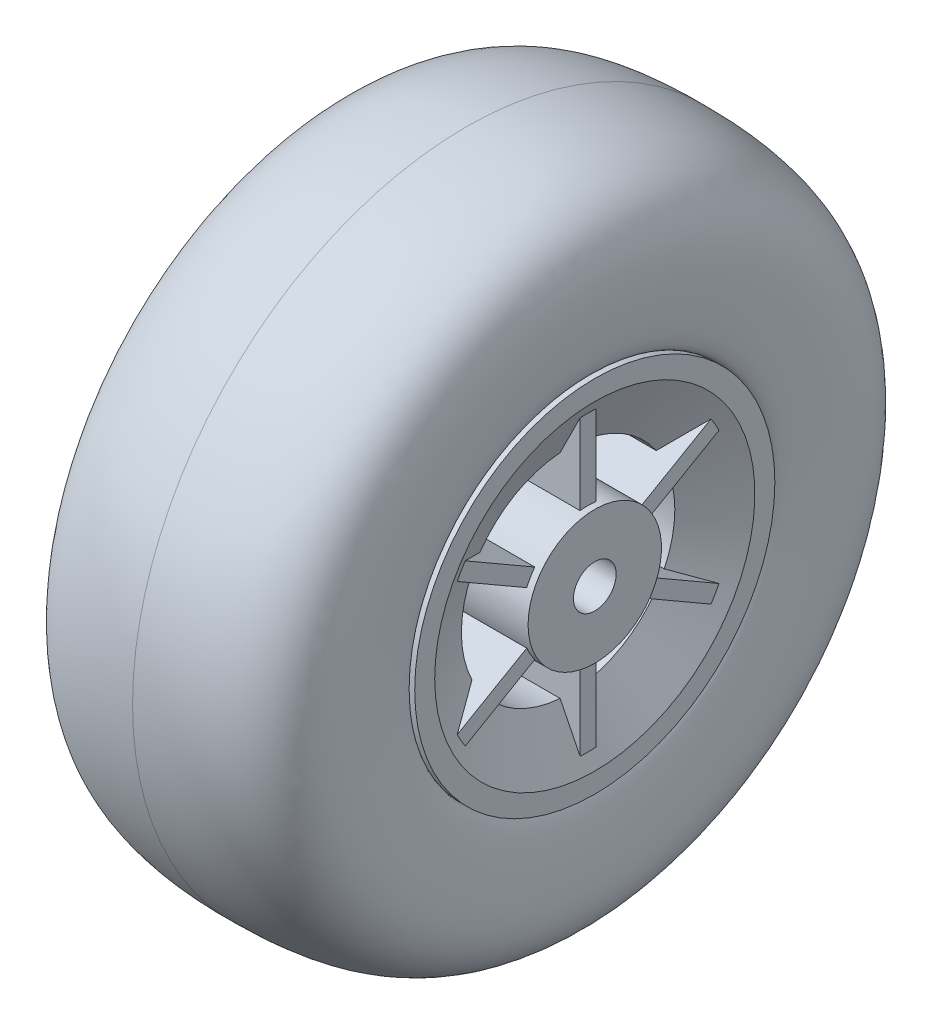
from build123d import *

# Parameters (mm, degrees)
BOSS_EXTRU_1_REACH           = 28.794
ESQUISSE2_W                  = 1.2
ESQUISSE2_H                  = 7.036130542
R_P_TITION_CIRCULAIRE1_COUNT = 6


with BuildPart() as part:
    # Esquisse1 → R_volution1 (revolve)
    with BuildSketch(Plane.XY, mode=Mode.PRIVATE) as r_volution1_sk:
        Polygon((9.65, 13.5), (9.65, 12), (7.65, 8), (3.65, 8), (3.65, 5), (9.65, 5), (9.65, 1.6), (-9.65, 1.6), (-9.65, 5), (-3.65, 5), (-3.65, 8), (-7.65, 8), (-9.65, 12), (-9.65, 13.5), (-8.45, 13.5), (-8.45, 12.283281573), (-6.908359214, 9.2), (6.908359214, 9.2), (8.45, 12.283281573), (8.45, 13.5), align=None)
    revolve(r_volution1_sk.sketch.rotate(Axis((0, 0, 0), (1, 0, 0)), 90), axis=Axis((0, 0, 0), (1, 0, 0)))

    # Esquisse2 → Boss.-Extru.1 (add, up to next)
    with BuildSketch(Plane(origin=(9.15, 0, 0), x_dir=(0, 0, -1), z_dir=(1, 0, 0)), mode=Mode.PRIVATE) as boss_extru_1_sk1:
        with Locations((0, 8.481934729)):
            Rectangle(ESQUISSE2_W, ESQUISSE2_H)
    boss_extru_1_tool1 = extrude(boss_extru_1_sk1.sketch, amount=-BOSS_EXTRU_1_REACH, mode=Mode.PRIVATE) - part.part
    boss_extru_1 = boss_extru_1_tool1.solids().sort_by_distance((9.15, 8.481935, 0))[0]
    add(boss_extru_1)

    # R_p_tition circulaire1: Boss.-Extru.1 ×6 about axis
    r_p_tition_circulaire1_axis = Axis((0, 0, 0), (1, 0, 0))
    for i in range(1, R_P_TITION_CIRCULAIRE1_COUNT):
        add(boss_extru_1.rotate(r_p_tition_circulaire1_axis, i * 360 / R_P_TITION_CIRCULAIRE1_COUNT))

    # Esquisse3 → R_volution2 (revolve)
    with BuildSketch(Plane.XY, mode=Mode.PRIVATE) as r_volution2_sk:
        with BuildLine():
            Line((8.45, 13.483762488), (8.45, 12.283281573))
            Line((8.45, 12.283281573), (6.908359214, 9.2))
            Line((6.908359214, 9.2), (-6.908359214, 9.2))
            Line((-6.908359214, 9.2), (-8.45, 12.283281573))
            Line((-8.45, 12.283281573), (-8.45, 13.483762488))
            add(Edge.make_bspline(
                [(0, 25), (-5.715325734, 25), (-10.265474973, 23.637268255), (-9.74404463, 12.978985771), (-9.452487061, 13.483762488), (-8.45, 13.483762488)],
                knots=[0, 0, 0, 0, 0.416684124, 0.516684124, 1, 1, 1, 1], degree=3))
            add(Edge.make_bspline(
                [(0, 25), (5.715325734, 25), (10.265474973, 23.637268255), (9.74404463, 12.978985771), (9.452487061, 13.483762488), (8.45, 13.483762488)],
                knots=[0, 0, 0, 0, 0.416684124, 0.516684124, 1, 1, 1, 1], degree=3))
        make_face()
    revolve(r_volution2_sk.sketch.rotate(Axis((0, 0, 0), (1, 0, 0)), 90), axis=Axis((0, 0, 0), (1, 0, 0)))


solid = part.part
